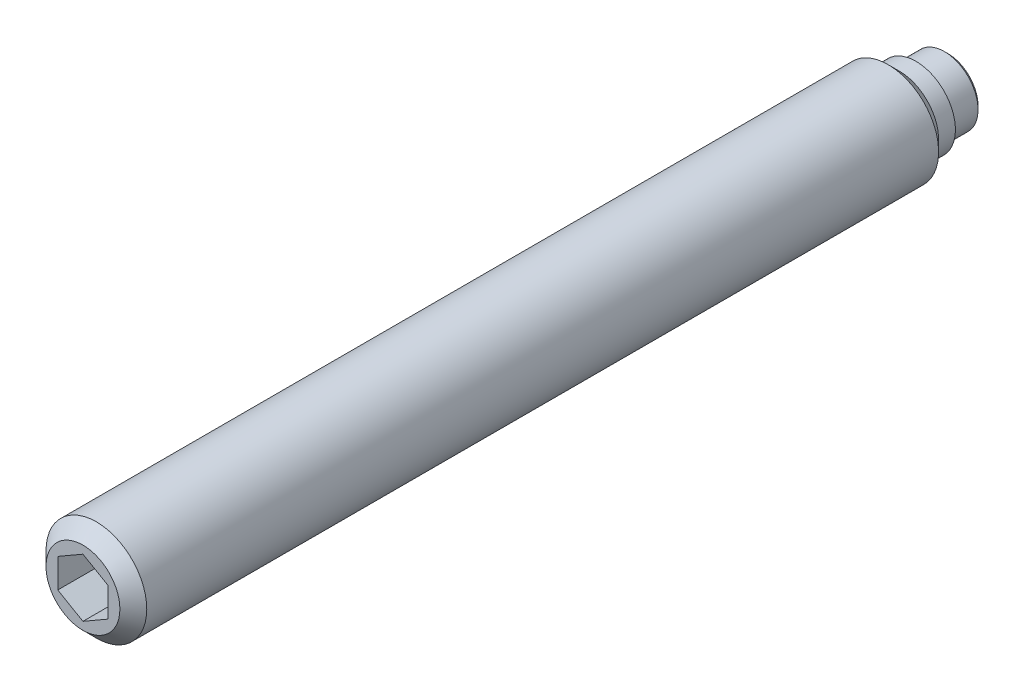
ISO-10303-21;
HEADER;
FILE_DESCRIPTION(('STEP AP214'),'2;1');
FILE_NAME('part.step','',(''),(''),'','','');
FILE_SCHEMA(('AUTOMOTIVE_DESIGN { 1 0 10303 214 1 1 1 1 }'));
ENDSEC;
DATA;
#1=APPLICATION_CONTEXT('core data for automotive mechanical design processes');
#2=APPLICATION_PROTOCOL_DEFINITION('international standard','automotive_design',2000,#1);
#3=PRODUCT_CONTEXT('',#1,'mechanical');
#4=PRODUCT('Part','Part','',(#3));
#5=PRODUCT_RELATED_PRODUCT_CATEGORY('part','',(#4));
#6=PRODUCT_DEFINITION_FORMATION('','',#4);
#7=PRODUCT_DEFINITION_CONTEXT('part definition',#1,'design');
#8=PRODUCT_DEFINITION('design','',#6,#7);
#9=PRODUCT_DEFINITION_SHAPE('','',#8);
#10=(LENGTH_UNIT() NAMED_UNIT(*) SI_UNIT(.MILLI.,.METRE.));
#11=(NAMED_UNIT(*) PLANE_ANGLE_UNIT() SI_UNIT($,.RADIAN.));
#12=(NAMED_UNIT(*) SI_UNIT($,.STERADIAN.) SOLID_ANGLE_UNIT());
#13=UNCERTAINTY_MEASURE_WITH_UNIT(LENGTH_MEASURE(1.E-05),#10,'distance_accuracy_value','');
#14=(GEOMETRIC_REPRESENTATION_CONTEXT(3) GLOBAL_UNCERTAINTY_ASSIGNED_CONTEXT((#13)) GLOBAL_UNIT_ASSIGNED_CONTEXT((#10,
#11,#12)) REPRESENTATION_CONTEXT('',''));
#15=CARTESIAN_POINT('',(0.,0.,0.));
#16=DIRECTION('',(0.,0.,1.));
#17=DIRECTION('',(1.,0.,0.));
#18=AXIS2_PLACEMENT_3D('',#15,#16,#17);
#19=CARTESIAN_POINT('',(0.,0.,1.9));
#20=DIRECTION('',(0.,0.,-1.));
#21=DIRECTION('',(-1.,0.,0.));
#22=AXIS2_PLACEMENT_3D('',#19,#20,#21);
#23=CYLINDRICAL_SURFACE('',#22,3.);
#24=CARTESIAN_POINT('',(0.,0.,3.55));
#25=DIRECTION('',(0.,0.,-1.));
#26=DIRECTION('',(-1.,0.,0.));
#27=AXIS2_PLACEMENT_3D('',#24,#25,#26);
#28=CIRCLE('',#27,3.);
#29=CARTESIAN_POINT('',(-3.,0.,3.55));
#30=VERTEX_POINT('',#29);
#31=EDGE_CURVE('E9',#30,#30,#28,.T.);
#32=ORIENTED_EDGE('',*,*,#31,.F.);
#33=EDGE_LOOP('',(#32));
#34=FACE_BOUND('',#33,.T.);
#35=CARTESIAN_POINT('',(0.,0.,50.7));
#36=DIRECTION('',(0.,0.,1.));
#37=DIRECTION('',(1.,0.,0.));
#38=AXIS2_PLACEMENT_3D('',#35,#36,#37);
#39=CIRCLE('',#38,3.);
#40=CARTESIAN_POINT('',(3.,0.,50.7));
#41=VERTEX_POINT('',#40);
#42=EDGE_CURVE('E123',#41,#41,#39,.T.);
#43=ORIENTED_EDGE('',*,*,#42,.F.);
#44=EDGE_LOOP('',(#43));
#45=FACE_BOUND('',#44,.T.);
#46=ADVANCED_FACE('F14',(#34,#45),#23,.T.);
#47=CARTESIAN_POINT('',(0.,0.,3.55));
#48=DIRECTION('',(0.,0.,1.));
#49=DIRECTION('',(1.,0.,0.));
#50=AXIS2_PLACEMENT_3D('',#47,#48,#49);
#51=CONICAL_SURFACE('',#50,3.,0.785398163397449);
#52=ORIENTED_EDGE('',*,*,#31,.T.);
#53=EDGE_LOOP('',(#52));
#54=FACE_BOUND('',#53,.T.);
#55=CARTESIAN_POINT('',(0.,0.,2.9));
#56=DIRECTION('',(0.,0.,-1.));
#57=DIRECTION('',(-1.,0.,0.));
#58=AXIS2_PLACEMENT_3D('',#55,#56,#57);
#59=CIRCLE('',#58,2.35);
#60=CARTESIAN_POINT('',(-2.35,0.,2.9));
#61=VERTEX_POINT('',#60);
#62=EDGE_CURVE('E21',#61,#61,#59,.T.);
#63=ORIENTED_EDGE('',*,*,#62,.F.);
#64=EDGE_LOOP('',(#63));
#65=FACE_BOUND('',#64,.T.);
#66=ADVANCED_FACE('F143',(#54,#65),#51,.T.);
#67=CARTESIAN_POINT('',(0.,0.,1.9));
#68=DIRECTION('',(0.,0.,-1.));
#69=DIRECTION('',(-1.,0.,0.));
#70=AXIS2_PLACEMENT_3D('',#67,#68,#69);
#71=CYLINDRICAL_SURFACE('',#70,2.35);
#72=ORIENTED_EDGE('',*,*,#62,.T.);
#73=EDGE_LOOP('',(#72));
#74=FACE_BOUND('',#73,.T.);
#75=CARTESIAN_POINT('',(0.,0.,1.9));
#76=DIRECTION('',(0.,0.,-1.));
#77=DIRECTION('',(-1.,0.,0.));
#78=AXIS2_PLACEMENT_3D('',#75,#76,#77);
#79=CIRCLE('',#78,2.35);
#80=CARTESIAN_POINT('',(-2.35,0.,1.9));
#81=VERTEX_POINT('',#80);
#82=EDGE_CURVE('E135',#81,#81,#79,.T.);
#83=ORIENTED_EDGE('',*,*,#82,.F.);
#84=EDGE_LOOP('',(#83));
#85=FACE_BOUND('',#84,.T.);
#86=ADVANCED_FACE('F140',(#74,#85),#71,.T.);
#87=CARTESIAN_POINT('',(0.,2.35,1.9));
#88=DIRECTION('',(0.,0.,1.));
#89=DIRECTION('',(1.,0.,0.));
#90=AXIS2_PLACEMENT_3D('',#87,#88,#89);
#91=PLANE('',#90);
#92=ORIENTED_EDGE('',*,*,#82,.T.);
#93=EDGE_LOOP('',(#92));
#94=FACE_BOUND('',#93,.T.);
#95=CARTESIAN_POINT('',(0.,0.,1.9));
#96=DIRECTION('',(0.,0.,-1.));
#97=DIRECTION('',(-1.,0.,0.));
#98=AXIS2_PLACEMENT_3D('',#95,#96,#97);
#99=CIRCLE('',#98,2.);
#100=CARTESIAN_POINT('',(-2.,0.,1.9));
#101=VERTEX_POINT('',#100);
#102=EDGE_CURVE('E132',#101,#101,#99,.T.);
#103=ORIENTED_EDGE('',*,*,#102,.F.);
#104=EDGE_LOOP('',(#103));
#105=FACE_BOUND('',#104,.T.);
#106=ADVANCED_FACE('F151',(#94,#105),#91,.F.);
#107=CARTESIAN_POINT('',(0.,0.,0.));
#108=DIRECTION('',(0.,0.,-1.));
#109=DIRECTION('',(-1.,0.,0.));
#110=AXIS2_PLACEMENT_3D('',#107,#108,#109);
#111=CYLINDRICAL_SURFACE('',#110,2.);
#112=CARTESIAN_POINT('',(0.,0.,0.2));
#113=DIRECTION('',(0.,0.,-1.));
#114=DIRECTION('',(-1.,0.,0.));
#115=AXIS2_PLACEMENT_3D('',#112,#113,#114);
#116=CIRCLE('',#115,2.);
#117=CARTESIAN_POINT('',(-2.,0.,0.2));
#118=VERTEX_POINT('',#117);
#119=EDGE_CURVE('E129',#118,#118,#116,.T.);
#120=ORIENTED_EDGE('',*,*,#119,.F.);
#121=EDGE_LOOP('',(#120));
#122=FACE_BOUND('',#121,.T.);
#123=ORIENTED_EDGE('',*,*,#102,.T.);
#124=EDGE_LOOP('',(#123));
#125=FACE_BOUND('',#124,.T.);
#126=ADVANCED_FACE('F157',(#122,#125),#111,.T.);
#127=CARTESIAN_POINT('',(0.,0.,0.2));
#128=DIRECTION('',(0.,0.,1.));
#129=DIRECTION('',(1.,0.,0.));
#130=AXIS2_PLACEMENT_3D('',#127,#128,#129);
#131=CONICAL_SURFACE('',#130,2.,0.785398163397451);
#132=CARTESIAN_POINT('',(0.,0.,0.));
#133=DIRECTION('',(0.,0.,-1.));
#134=DIRECTION('',(-1.,0.,0.));
#135=AXIS2_PLACEMENT_3D('',#132,#133,#134);
#136=CIRCLE('',#135,1.8);
#137=CARTESIAN_POINT('',(-1.8,0.,0.));
#138=VERTEX_POINT('',#137);
#139=EDGE_CURVE('E126',#138,#138,#136,.T.);
#140=ORIENTED_EDGE('',*,*,#139,.F.);
#141=EDGE_LOOP('',(#140));
#142=FACE_BOUND('',#141,.T.);
#143=ORIENTED_EDGE('',*,*,#119,.T.);
#144=EDGE_LOOP('',(#143));
#145=FACE_BOUND('',#144,.T.);
#146=ADVANCED_FACE('F161',(#142,#145),#131,.T.);
#147=CARTESIAN_POINT('',(0.,1.8,0.));
#148=DIRECTION('',(0.,0.,1.));
#149=DIRECTION('',(1.,0.,0.));
#150=AXIS2_PLACEMENT_3D('',#147,#148,#149);
#151=PLANE('',#150);
#152=ORIENTED_EDGE('',*,*,#139,.T.);
#153=EDGE_LOOP('',(#152));
#154=FACE_BOUND('',#153,.T.);
#155=ADVANCED_FACE('F165',(#154),#151,.F.);
#156=CARTESIAN_POINT('',(0.,0.,51.5));
#157=DIRECTION('',(0.,0.,-1.));
#158=DIRECTION('',(-1.,0.,0.));
#159=AXIS2_PLACEMENT_3D('',#156,#157,#158);
#160=CONICAL_SURFACE('',#159,2.2,0.785398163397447);
#161=ORIENTED_EDGE('',*,*,#42,.T.);
#162=EDGE_LOOP('',(#161));
#163=FACE_BOUND('',#162,.T.);
#164=CARTESIAN_POINT('',(0.,0.,51.5));
#165=DIRECTION('',(0.,0.,1.));
#166=DIRECTION('',(1.,0.,0.));
#167=AXIS2_PLACEMENT_3D('',#164,#165,#166);
#168=CIRCLE('',#167,2.2);
#169=CARTESIAN_POINT('',(2.2,0.,51.5));
#170=VERTEX_POINT('',#169);
#171=EDGE_CURVE('E115',#170,#170,#168,.T.);
#172=ORIENTED_EDGE('',*,*,#171,.F.);
#173=EDGE_LOOP('',(#172));
#174=FACE_BOUND('',#173,.T.);
#175=ADVANCED_FACE('F169',(#163,#174),#160,.T.);
#176=CARTESIAN_POINT('',(0.,0.,51.5));
#177=DIRECTION('',(0.,0.,1.));
#178=DIRECTION('',(1.,0.,0.));
#179=AXIS2_PLACEMENT_3D('',#176,#177,#178);
#180=PLANE('',#179);
#181=DIRECTION('',(0.866025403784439,-0.5,0.));
#182=VECTOR('',#181,1.);
#183=CARTESIAN_POINT('',(-1.5,-0.866025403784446,51.5));
#184=LINE('',#183,#182);
#185=CARTESIAN_POINT('',(-1.5,-0.866025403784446,51.5));
#186=VERTEX_POINT('',#185);
#187=CARTESIAN_POINT('',(0.,-1.73205080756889,51.5));
#188=VERTEX_POINT('',#187);
#189=EDGE_CURVE('E28',#186,#188,#184,.T.);
#190=ORIENTED_EDGE('',*,*,#189,.F.);
#191=DIRECTION('',(0.,-1.,0.));
#192=VECTOR('',#191,1.);
#193=CARTESIAN_POINT('',(-1.5,0.866025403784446,51.5));
#194=LINE('',#193,#192);
#195=CARTESIAN_POINT('',(-1.5,0.866025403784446,51.5));
#196=VERTEX_POINT('',#195);
#197=EDGE_CURVE('E111',#196,#186,#194,.T.);
#198=ORIENTED_EDGE('',*,*,#197,.F.);
#199=DIRECTION('',(-0.866025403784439,-0.5,0.));
#200=VECTOR('',#199,1.);
#201=CARTESIAN_POINT('',(0.,1.73205080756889,51.5));
#202=LINE('',#201,#200);
#203=CARTESIAN_POINT('',(0.,1.73205080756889,51.5));
#204=VERTEX_POINT('',#203);
#205=EDGE_CURVE('E109',#204,#196,#202,.T.);
#206=ORIENTED_EDGE('',*,*,#205,.F.);
#207=DIRECTION('',(-0.866025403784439,0.5,0.));
#208=VECTOR('',#207,1.);
#209=CARTESIAN_POINT('',(1.5,0.866025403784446,51.5));
#210=LINE('',#209,#208);
#211=CARTESIAN_POINT('',(1.5,0.866025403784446,51.5));
#212=VERTEX_POINT('',#211);
#213=EDGE_CURVE('E76',#212,#204,#210,.T.);
#214=ORIENTED_EDGE('',*,*,#213,.F.);
#215=DIRECTION('',(0.,1.,0.));
#216=VECTOR('',#215,1.);
#217=CARTESIAN_POINT('',(1.5,-0.866025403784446,51.5));
#218=LINE('',#217,#216);
#219=CARTESIAN_POINT('',(1.5,-0.866025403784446,51.5));
#220=VERTEX_POINT('',#219);
#221=EDGE_CURVE('E105',#220,#212,#218,.T.);
#222=ORIENTED_EDGE('',*,*,#221,.F.);
#223=DIRECTION('',(0.866025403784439,0.5,0.));
#224=VECTOR('',#223,1.);
#225=CARTESIAN_POINT('',(0.,-1.73205080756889,51.5));
#226=LINE('',#225,#224);
#227=EDGE_CURVE('E102',#188,#220,#226,.T.);
#228=ORIENTED_EDGE('',*,*,#227,.F.);
#229=EDGE_LOOP('',(#190,#198,#206,#214,#222,#228));
#230=FACE_BOUND('',#229,.T.);
#231=ORIENTED_EDGE('',*,*,#171,.T.);
#232=EDGE_LOOP('',(#231));
#233=FACE_BOUND('',#232,.T.);
#234=ADVANCED_FACE('F173',(#230,#233),#180,.T.);
#235=CARTESIAN_POINT('',(-1.5,-0.866025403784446,48.));
#236=DIRECTION('',(-0.5,-0.866025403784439,0.));
#237=DIRECTION('',(0.866025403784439,-0.5,0.));
#238=AXIS2_PLACEMENT_3D('',#235,#236,#237);
#239=PLANE('',#238);
#240=ORIENTED_EDGE('',*,*,#189,.T.);
#241=DIRECTION('',(0.,0.,1.));
#242=VECTOR('',#241,1.);
#243=CARTESIAN_POINT('',(0.,-1.73205080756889,48.));
#244=LINE('',#243,#242);
#245=CARTESIAN_POINT('',(0.,-1.73205080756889,48.));
#246=VERTEX_POINT('',#245);
#247=EDGE_CURVE('E58',#246,#188,#244,.T.);
#248=ORIENTED_EDGE('',*,*,#247,.F.);
#249=DIRECTION('',(0.866025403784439,-0.5,0.));
#250=VECTOR('',#249,1.);
#251=CARTESIAN_POINT('',(-1.5,-0.866025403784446,48.));
#252=LINE('',#251,#250);
#253=CARTESIAN_POINT('',(-1.5,-0.866025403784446,48.));
#254=VERTEX_POINT('',#253);
#255=EDGE_CURVE('E113',#254,#246,#252,.T.);
#256=ORIENTED_EDGE('',*,*,#255,.F.);
#257=DIRECTION('',(0.,0.,1.));
#258=VECTOR('',#257,1.);
#259=CARTESIAN_POINT('',(-1.5,-0.866025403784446,48.));
#260=LINE('',#259,#258);
#261=EDGE_CURVE('E36',#254,#186,#260,.T.);
#262=ORIENTED_EDGE('',*,*,#261,.T.);
#263=EDGE_LOOP('',(#240,#248,#256,#262));
#264=FACE_BOUND('',#263,.T.);
#265=ADVANCED_FACE('F177',(#264),#239,.F.);
#266=CARTESIAN_POINT('',(-1.5,0.866025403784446,48.));
#267=DIRECTION('',(-1.,0.,0.));
#268=DIRECTION('',(0.,0.,1.));
#269=AXIS2_PLACEMENT_3D('',#266,#267,#268);
#270=PLANE('',#269);
#271=ORIENTED_EDGE('',*,*,#197,.T.);
#272=ORIENTED_EDGE('',*,*,#261,.F.);
#273=DIRECTION('',(0.,-1.,0.));
#274=VECTOR('',#273,1.);
#275=CARTESIAN_POINT('',(-1.5,0.866025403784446,48.));
#276=LINE('',#275,#274);
#277=CARTESIAN_POINT('',(-1.5,0.866025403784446,48.));
#278=VERTEX_POINT('',#277);
#279=EDGE_CURVE('E88',#278,#254,#276,.T.);
#280=ORIENTED_EDGE('',*,*,#279,.F.);
#281=DIRECTION('',(0.,0.,1.));
#282=VECTOR('',#281,1.);
#283=CARTESIAN_POINT('',(-1.5,0.866025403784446,48.));
#284=LINE('',#283,#282);
#285=EDGE_CURVE('E80',#278,#196,#284,.T.);
#286=ORIENTED_EDGE('',*,*,#285,.T.);
#287=EDGE_LOOP('',(#271,#272,#280,#286));
#288=FACE_BOUND('',#287,.T.);
#289=ADVANCED_FACE('F181',(#288),#270,.F.);
#290=CARTESIAN_POINT('',(0.,1.73205080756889,48.));
#291=DIRECTION('',(-0.5,0.866025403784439,0.));
#292=DIRECTION('',(-0.866025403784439,-0.5,0.));
#293=AXIS2_PLACEMENT_3D('',#290,#291,#292);
#294=PLANE('',#293);
#295=ORIENTED_EDGE('',*,*,#205,.T.);
#296=ORIENTED_EDGE('',*,*,#285,.F.);
#297=DIRECTION('',(-0.866025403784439,-0.5,0.));
#298=VECTOR('',#297,1.);
#299=CARTESIAN_POINT('',(0.,1.73205080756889,48.));
#300=LINE('',#299,#298);
#301=CARTESIAN_POINT('',(0.,1.73205080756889,48.));
#302=VERTEX_POINT('',#301);
#303=EDGE_CURVE('E84',#302,#278,#300,.T.);
#304=ORIENTED_EDGE('',*,*,#303,.F.);
#305=DIRECTION('',(0.,0.,1.));
#306=VECTOR('',#305,1.);
#307=CARTESIAN_POINT('',(0.,1.73205080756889,48.));
#308=LINE('',#307,#306);
#309=EDGE_CURVE('E69',#302,#204,#308,.T.);
#310=ORIENTED_EDGE('',*,*,#309,.T.);
#311=EDGE_LOOP('',(#295,#296,#304,#310));
#312=FACE_BOUND('',#311,.T.);
#313=ADVANCED_FACE('F85',(#312),#294,.F.);
#314=CARTESIAN_POINT('',(1.5,0.866025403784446,48.));
#315=DIRECTION('',(0.5,0.866025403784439,0.));
#316=DIRECTION('',(-0.866025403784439,0.5,0.));
#317=AXIS2_PLACEMENT_3D('',#314,#315,#316);
#318=PLANE('',#317);
#319=ORIENTED_EDGE('',*,*,#213,.T.);
#320=ORIENTED_EDGE('',*,*,#309,.F.);
#321=DIRECTION('',(-0.866025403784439,0.5,0.));
#322=VECTOR('',#321,1.);
#323=CARTESIAN_POINT('',(1.5,0.866025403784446,48.));
#324=LINE('',#323,#322);
#325=CARTESIAN_POINT('',(1.5,0.866025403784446,48.));
#326=VERTEX_POINT('',#325);
#327=EDGE_CURVE('E73',#326,#302,#324,.T.);
#328=ORIENTED_EDGE('',*,*,#327,.F.);
#329=DIRECTION('',(0.,0.,1.));
#330=VECTOR('',#329,1.);
#331=CARTESIAN_POINT('',(1.5,0.866025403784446,48.));
#332=LINE('',#331,#330);
#333=EDGE_CURVE('E81',#326,#212,#332,.T.);
#334=ORIENTED_EDGE('',*,*,#333,.T.);
#335=EDGE_LOOP('',(#319,#320,#328,#334));
#336=FACE_BOUND('',#335,.T.);
#337=ADVANCED_FACE('F71',(#336),#318,.F.);
#338=CARTESIAN_POINT('',(1.5,-0.866025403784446,48.));
#339=DIRECTION('',(1.,0.,0.));
#340=DIRECTION('',(0.,0.,-1.));
#341=AXIS2_PLACEMENT_3D('',#338,#339,#340);
#342=PLANE('',#341);
#343=ORIENTED_EDGE('',*,*,#221,.T.);
#344=ORIENTED_EDGE('',*,*,#333,.F.);
#345=DIRECTION('',(0.,1.,0.));
#346=VECTOR('',#345,1.);
#347=CARTESIAN_POINT('',(1.5,-0.866025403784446,48.));
#348=LINE('',#347,#346);
#349=CARTESIAN_POINT('',(1.5,-0.866025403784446,48.));
#350=VERTEX_POINT('',#349);
#351=EDGE_CURVE('E94',#350,#326,#348,.T.);
#352=ORIENTED_EDGE('',*,*,#351,.F.);
#353=DIRECTION('',(0.,0.,1.));
#354=VECTOR('',#353,1.);
#355=CARTESIAN_POINT('',(1.5,-0.866025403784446,48.));
#356=LINE('',#355,#354);
#357=EDGE_CURVE('E118',#350,#220,#356,.T.);
#358=ORIENTED_EDGE('',*,*,#357,.T.);
#359=EDGE_LOOP('',(#343,#344,#352,#358));
#360=FACE_BOUND('',#359,.T.);
#361=ADVANCED_FACE('F185',(#360),#342,.F.);
#362=CARTESIAN_POINT('',(0.,-1.73205080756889,48.));
#363=DIRECTION('',(0.5,-0.866025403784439,0.));
#364=DIRECTION('',(0.866025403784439,0.5,0.));
#365=AXIS2_PLACEMENT_3D('',#362,#363,#364);
#366=PLANE('',#365);
#367=ORIENTED_EDGE('',*,*,#227,.T.);
#368=ORIENTED_EDGE('',*,*,#357,.F.);
#369=DIRECTION('',(0.866025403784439,0.5,0.));
#370=VECTOR('',#369,1.);
#371=CARTESIAN_POINT('',(0.,-1.73205080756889,48.));
#372=LINE('',#371,#370);
#373=EDGE_CURVE('E96',#246,#350,#372,.T.);
#374=ORIENTED_EDGE('',*,*,#373,.F.);
#375=ORIENTED_EDGE('',*,*,#247,.T.);
#376=EDGE_LOOP('',(#367,#368,#374,#375));
#377=FACE_BOUND('',#376,.T.);
#378=ADVANCED_FACE('F182',(#377),#366,.F.);
#379=CARTESIAN_POINT('',(0.,0.,48.));
#380=DIRECTION('',(0.,0.,1.));
#381=DIRECTION('',(1.,0.,0.));
#382=AXIS2_PLACEMENT_3D('',#379,#380,#381);
#383=PLANE('',#382);
#384=ORIENTED_EDGE('',*,*,#255,.T.);
#385=ORIENTED_EDGE('',*,*,#373,.T.);
#386=ORIENTED_EDGE('',*,*,#351,.T.);
#387=ORIENTED_EDGE('',*,*,#327,.T.);
#388=ORIENTED_EDGE('',*,*,#303,.T.);
#389=ORIENTED_EDGE('',*,*,#279,.T.);
#390=EDGE_LOOP('',(#384,#385,#386,#387,#388,#389));
#391=FACE_BOUND('',#390,.T.);
#392=ADVANCED_FACE('F91',(#391),#383,.T.);
#393=CLOSED_SHELL('',(#46,#66,#86,#106,#126,#146,#155,#175,#234,#265,#289,#313,#337,#361,#378,#392));
#394=MANIFOLD_SOLID_BREP('B1',#393);
#395=ADVANCED_BREP_SHAPE_REPRESENTATION('',(#18,#394),#14);
#396=SHAPE_DEFINITION_REPRESENTATION(#9,#395);
ENDSEC;
END-ISO-10303-21;
